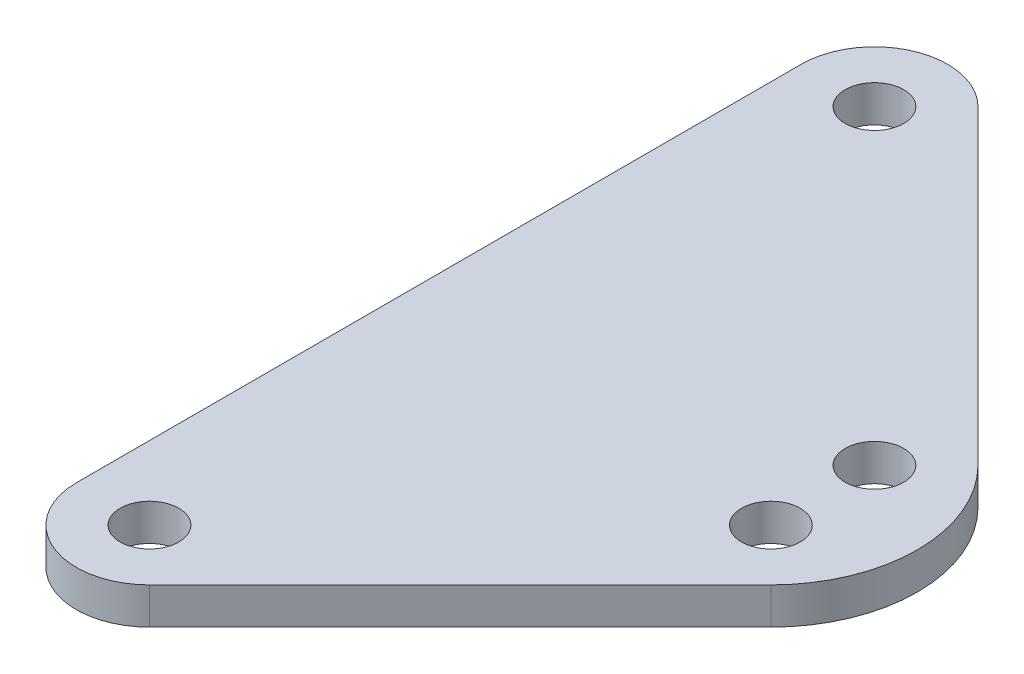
from build123d import *

# Parameters (mm, degrees)
SKETCH1_R           = 8
BOSS_EXTRUDE1_DEPTH = 10


with BuildPart() as part:
    # Sketch1 → Boss-Extrude1 (new body)
    with BuildSketch(Plane(origin=(0, 0, 0), x_dir=(1, 0, 0), z_dir=(0, 1, 0))):
        with BuildLine():
            Line((34.142135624, 34.142135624), (118.994949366, 118.994949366))
            ThreePointArc((118.994949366, 118.994949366), (130.710678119, 147.279220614), (118.994949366, 175.563491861))
            Line((118.994949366, 175.563491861), (34.142135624, 260.416305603))
            ThreePointArc((34.142135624, 260.416305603), (12.346331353, 264.75176063), (0, 246.27416998))
            Line((0, 246.27416998), (0, 48.284271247))
            ThreePointArc((0, 48.284271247), (12.346331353, 29.806680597), (34.142135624, 34.142135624))
        make_face()
        with Locations(Location((20, 48.284271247, 0), (0, 0, 270))):
            Circle(SKETCH1_R, mode=Mode.SUBTRACT)
        with Locations(Location((104.852813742, 133.13708499, 0), (0, 0, 270))):
            Circle(SKETCH1_R, mode=Mode.SUBTRACT)
        with Locations(Location((104.852813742, 161.421356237, 0), (0, 0, 270))):
            Circle(SKETCH1_R, mode=Mode.SUBTRACT)
        with Locations(Location((20, 246.27416998, 0), (0, 0, 270))):
            Circle(SKETCH1_R, mode=Mode.SUBTRACT)
    extrude(amount=BOSS_EXTRUDE1_DEPTH)


solid = part.part
